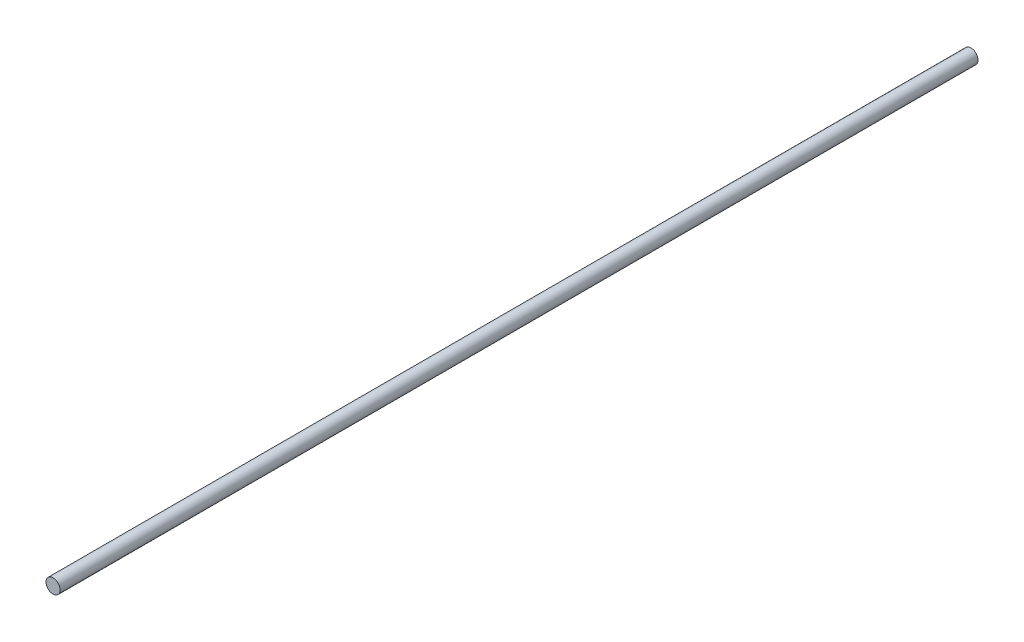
ISO-10303-21;
HEADER;
FILE_DESCRIPTION(('STEP AP214'),'2;1');
FILE_NAME('part.step','',(''),(''),'','','');
FILE_SCHEMA(('AUTOMOTIVE_DESIGN { 1 0 10303 214 1 1 1 1 }'));
ENDSEC;
DATA;
#1=APPLICATION_CONTEXT('core data for automotive mechanical design processes');
#2=APPLICATION_PROTOCOL_DEFINITION('international standard','automotive_design',2000,#1);
#3=PRODUCT_CONTEXT('',#1,'mechanical');
#4=PRODUCT('Part','Part','',(#3));
#5=PRODUCT_RELATED_PRODUCT_CATEGORY('part','',(#4));
#6=PRODUCT_DEFINITION_FORMATION('','',#4);
#7=PRODUCT_DEFINITION_CONTEXT('part definition',#1,'design');
#8=PRODUCT_DEFINITION('design','',#6,#7);
#9=PRODUCT_DEFINITION_SHAPE('','',#8);
#10=(LENGTH_UNIT() NAMED_UNIT(*) SI_UNIT(.MILLI.,.METRE.));
#11=(NAMED_UNIT(*) PLANE_ANGLE_UNIT() SI_UNIT($,.RADIAN.));
#12=(NAMED_UNIT(*) SI_UNIT($,.STERADIAN.) SOLID_ANGLE_UNIT());
#13=UNCERTAINTY_MEASURE_WITH_UNIT(LENGTH_MEASURE(1.E-05),#10,'distance_accuracy_value','');
#14=(GEOMETRIC_REPRESENTATION_CONTEXT(3) GLOBAL_UNCERTAINTY_ASSIGNED_CONTEXT((#13)) GLOBAL_UNIT_ASSIGNED_CONTEXT((#10,
#11,#12)) REPRESENTATION_CONTEXT('',''));
#15=CARTESIAN_POINT('',(0.,0.,0.));
#16=DIRECTION('',(0.,0.,1.));
#17=DIRECTION('',(1.,0.,0.));
#18=AXIS2_PLACEMENT_3D('',#15,#16,#17);
#19=CARTESIAN_POINT('',(0.,0.,-3900.));
#20=DIRECTION('',(0.,0.,1.));
#21=DIRECTION('',(1.,0.,0.));
#22=AXIS2_PLACEMENT_3D('',#19,#20,#21);
#23=CYLINDRICAL_SURFACE('',#22,30.);
#24=CARTESIAN_POINT('',(0.,0.,-3900.));
#25=DIRECTION('',(0.,0.,1.));
#26=DIRECTION('',(1.,0.,0.));
#27=AXIS2_PLACEMENT_3D('',#24,#25,#26);
#28=CIRCLE('',#27,30.);
#29=CARTESIAN_POINT('',(30.,0.,-3900.));
#30=VERTEX_POINT('',#29);
#31=EDGE_CURVE('E10',#30,#30,#28,.T.);
#32=ORIENTED_EDGE('',*,*,#31,.T.);
#33=EDGE_LOOP('',(#32));
#34=FACE_BOUND('',#33,.T.);
#35=CARTESIAN_POINT('',(0.,0.,0.));
#36=DIRECTION('',(0.,0.,1.));
#37=DIRECTION('',(1.,0.,0.));
#38=AXIS2_PLACEMENT_3D('',#35,#36,#37);
#39=CIRCLE('',#38,30.);
#40=CARTESIAN_POINT('',(30.,0.,0.));
#41=VERTEX_POINT('',#40);
#42=EDGE_CURVE('E40',#41,#41,#39,.T.);
#43=ORIENTED_EDGE('',*,*,#42,.F.);
#44=EDGE_LOOP('',(#43));
#45=FACE_BOUND('',#44,.T.);
#46=ADVANCED_FACE('F37',(#34,#45),#23,.T.);
#47=CARTESIAN_POINT('',(0.,0.,-3900.));
#48=DIRECTION('',(0.,0.,1.));
#49=DIRECTION('',(1.,0.,0.));
#50=AXIS2_PLACEMENT_3D('',#47,#48,#49);
#51=PLANE('',#50);
#52=ORIENTED_EDGE('',*,*,#31,.F.);
#53=EDGE_LOOP('',(#52));
#54=FACE_BOUND('',#53,.T.);
#55=ADVANCED_FACE('F54',(#54),#51,.F.);
#56=CARTESIAN_POINT('',(0.,0.,0.));
#57=DIRECTION('',(0.,0.,1.));
#58=DIRECTION('',(1.,0.,0.));
#59=AXIS2_PLACEMENT_3D('',#56,#57,#58);
#60=PLANE('',#59);
#61=ORIENTED_EDGE('',*,*,#42,.T.);
#62=EDGE_LOOP('',(#61));
#63=FACE_BOUND('',#62,.T.);
#64=ADVANCED_FACE('F51',(#63),#60,.T.);
#65=CLOSED_SHELL('',(#46,#55,#64));
#66=MANIFOLD_SOLID_BREP('B2',#65);
#67=ADVANCED_BREP_SHAPE_REPRESENTATION('',(#18,#66),#14);
#68=SHAPE_DEFINITION_REPRESENTATION(#9,#67);
ENDSEC;
END-ISO-10303-21;
